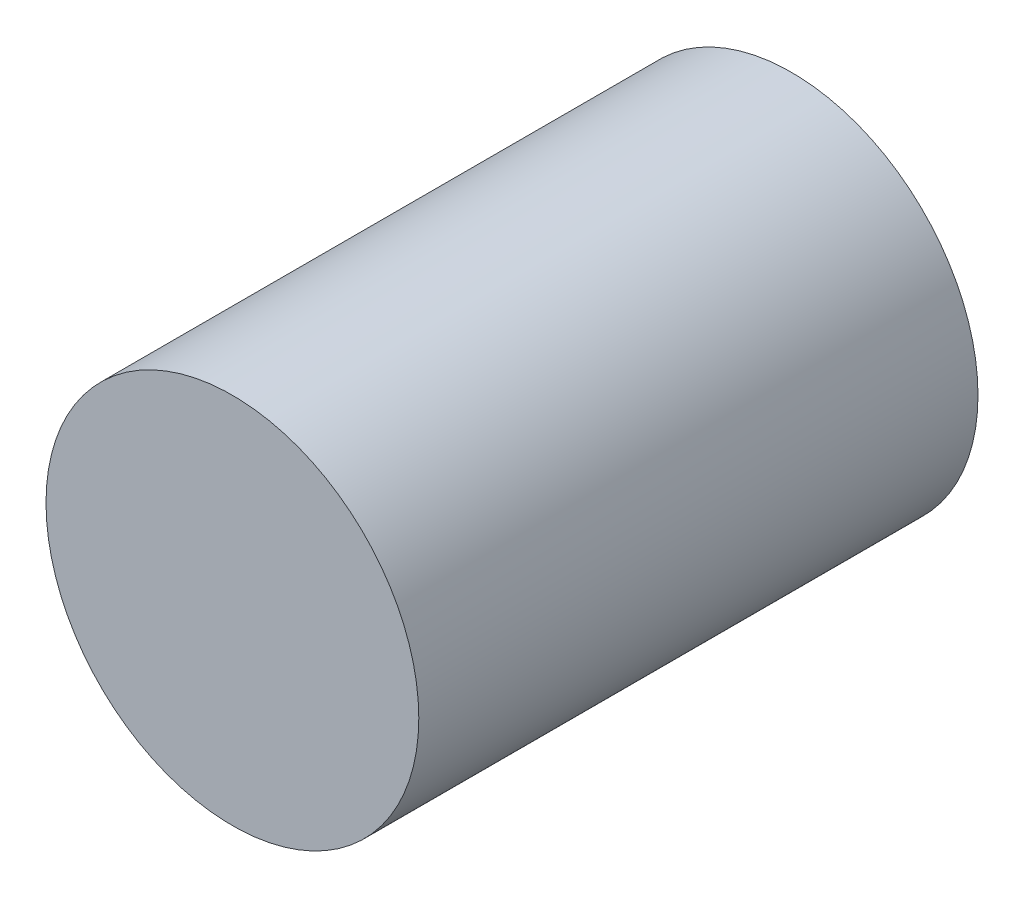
from build123d import *

# Parameters (mm, degrees)
SKETCH1_R      = 50.8
EXTRUDE1_DEPTH = 76.2


with BuildPart() as part:
    # Sketch1 → Extrude1 (new, symmetric)
    with BuildSketch(Plane.XY):
        with Locations(Location((0, 0, 0), (0, 0, 180))):
            Circle(SKETCH1_R)
    extrude(amount=EXTRUDE1_DEPTH, both=True)


solid = part.part
